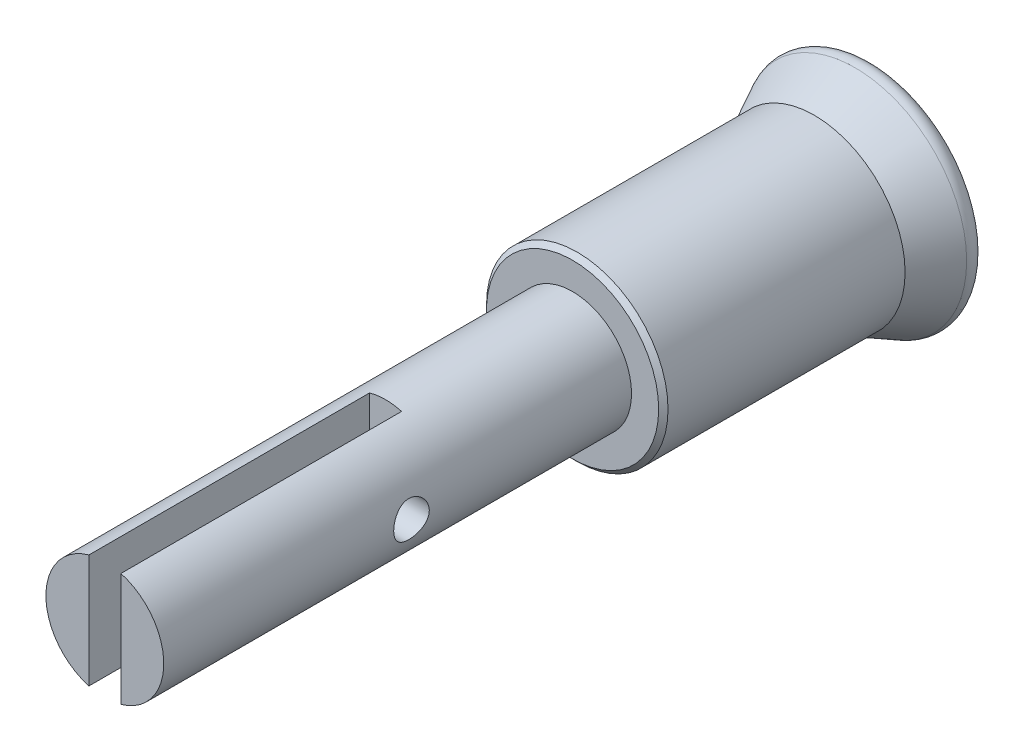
from build123d import *

# Parameters (mm, degrees)
SKETCH1_R           = 7.9375
BOSS_EXTRUDE1_DEPTH = 7.62
FILLET2_R           = 0.762
FILLET3_R           = 0.762
SKETCH2_R           = 6.35
BOSS_EXTRUDE2_DEPTH = 12.7
SKETCH3_R           = 4.0005
BOSS_EXTRUDE3_DEPTH = 31.75
CUT_EXTRUDE1_DEPTH  = 19.05
SKETCH5_R           = 1.2065
CUT_EXTRUDE2_DEPTH  = 63.5
CHAMFER1_SIZE       = 0.508
SKETCH6_R           = 8.89
BOSS_EXTRUDE4_DEPTH = 7.9375
CHAMFER2_SIZE       = 0.508
CUT_EXTRUDE3_DEPTH  = 7.9375
CIRPATTERN1_COUNT   = 47
SKETCH8_R           = 10.844072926
SKETCH8_R_2         = 6.1595
CUT_EXTRUDE4_DEPTH  = 30.48


with BuildPart() as part:
    # Sketch1 → Boss-Extrude1 (new body)
    with BuildSketch(Plane.XY):
        with Locations(Location((0, 0, 0), (0, 0, 180))):
            Circle(SKETCH1_R)
    extrude(amount=BOSS_EXTRUDE1_DEPTH)

    # Fillet2
    fillet2_edges = [part.edges().sort_by_distance(p)[0] for p in [
        (7.9375, 0, 7.62),
    ]]
    fillet(fillet2_edges, radius=FILLET2_R)

    # Fillet3
    fillet3_edges = [part.edges().sort_by_distance(p)[0] for p in [
        (7.9375, 0, 0),
    ]]
    fillet(fillet3_edges, radius=FILLET3_R)

    # Sketch2 → Boss-Extrude2 (add)
    with BuildSketch(Plane.XY.offset(7.62)):
        Circle(SKETCH2_R)
    extrude(amount=BOSS_EXTRUDE2_DEPTH)

    # Sketch3 → Boss-Extrude3 (add)
    with BuildSketch(Plane.XY.offset(20.32)):
        Circle(SKETCH3_R)
    extrude(amount=BOSS_EXTRUDE3_DEPTH)

    # Sketch4 → Cut-Extrude1 (cut)
    with BuildSketch(Plane.XY.offset(52.07)):
        with BuildLine():
            Line((-1.0795, 4.391041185), (-1.0795, -4.391041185))
            ThreePointArc((-1.0795, -4.391041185), (0.006541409, -4.521782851), (1.0922, -4.387899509))
            Line((1.0922, -4.387899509), (1.0922, 4.387899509))
            ThreePointArc((1.0922, 4.387899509), (0.006541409, 4.521782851), (-1.0795, 4.391041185))
        make_face()
    extrude(amount=-CUT_EXTRUDE1_DEPTH, mode=Mode.SUBTRACT)

    # Sketch5 → Cut-Extrude2 (cut, symmetric)
    with BuildSketch(Plane(origin=(0, 0, 0), x_dir=(0, 0, -1), z_dir=(1, 0, 0))):
        with Locations(Location((-35.255564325, 0, 0), (0, 0, 270))):
            Circle(SKETCH5_R)
    extrude(amount=CUT_EXTRUDE2_DEPTH, both=True, mode=Mode.SUBTRACT)

    # Chamfer1
    chamfer1_edges = [part.edges().sort_by_distance(p)[0] for p in [
        (-6.35, 0, 20.32),
    ]]
    chamfer(chamfer1_edges, length=CHAMFER1_SIZE)

    # Sketch6 → Boss-Extrude4 (add)
    with BuildSketch(Plane(origin=(0, 0, 0), x_dir=(-1, 0, 0), z_dir=(0, 0, -1))):
        Circle(SKETCH6_R)
    extrude(amount=-BOSS_EXTRUDE4_DEPTH)

    # Chamfer2
    chamfer2_edges = [part.edges().sort_by_distance(p)[0] for p in [
        (8.89, 0, 0),
        (8.89, 0, 7.9375),
    ]]
    chamfer(chamfer2_edges, length=CHAMFER2_SIZE)

    # Sketch7 → Cut-Extrude3 (cut)
    with BuildSketch(Plane(origin=(0, 0, 0), x_dir=(-1, 0, 0), z_dir=(0, 0, -1))):
        with BuildLine():
            Line((0.3048, 8.721482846), (0.3048, 9.009371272))
            ThreePointArc((0.3048, 9.009371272), (0.268484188, 9.098283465), (0.180305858, 9.136346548))
            ThreePointArc((0.180305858, 9.136346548), (0, 9.138125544), (-0.180305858, 9.136346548))
            ThreePointArc((-0.180305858, 9.136346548), (-0.268484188, 9.098283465), (-0.3048, 9.009371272))
            Line((-0.3048, 9.009371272), (-0.3048, 8.721482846))
            ThreePointArc((-0.3048, 8.721482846), (-0.266682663, 8.630769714), (-0.17521146, 8.594509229))
            ThreePointArc((-0.17521146, 8.594509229), (0, 8.596295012), (0.17521146, 8.594509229))
            ThreePointArc((0.17521146, 8.594509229), (0.266682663, 8.630769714), (0.3048, 8.721482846))
        make_face()
    cut_extrude3 = extrude(amount=-CUT_EXTRUDE3_DEPTH, mode=Mode.SUBTRACT)

    # CirPattern1: Cut-Extrude3 ×47 about axis
    cirpattern1_axis = Axis((0, 0, 0), (0, 0, 1))
    for i in range(1, CIRPATTERN1_COUNT):
        add(cut_extrude3.rotate(cirpattern1_axis, i * 360 / CIRPATTERN1_COUNT), mode=Mode.SUBTRACT)

    # Sketch8 → Cut-Extrude4 (cut)
    with BuildSketch(Plane.XY.offset(20.32)):
        Circle(SKETCH8_R)
        Circle(SKETCH8_R_2, mode=Mode.SUBTRACT)
    extrude(amount=-CUT_EXTRUDE4_DEPTH, mode=Mode.SUBTRACT)

    # Sketch9 → Revolve1 (revolve)
    with BuildSketch(Plane(origin=(0, 0, 0), x_dir=(1, 0, 0), z_dir=(0, 1, 0))):
        with BuildLine():
            Line((6.1595, 0), (6.8707, 0))
            ThreePointArc((6.8707, 0), (7.542249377, -0.376279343), (7.571964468, -1.145487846))
            Line((7.571964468, -1.145487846), (6.1595, -3.9116))
            Line((6.1595, -3.9116), (6.1595, 0))
        make_face()
    revolve(axis=Axis((0, 0, 0), (0, 0, -1)))


solid = part.part
